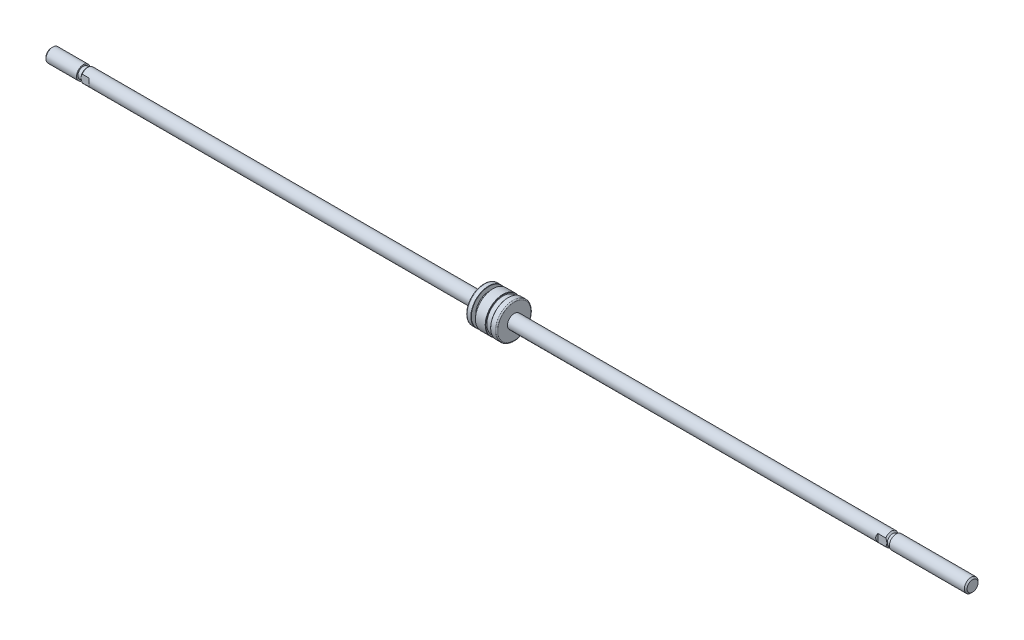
ISO-10303-21;
HEADER;
FILE_DESCRIPTION(('STEP AP214'),'2;1');
FILE_NAME('part.step','',(''),(''),'','','');
FILE_SCHEMA(('AUTOMOTIVE_DESIGN { 1 0 10303 214 1 1 1 1 }'));
ENDSEC;
DATA;
#1=APPLICATION_CONTEXT('core data for automotive mechanical design processes');
#2=APPLICATION_PROTOCOL_DEFINITION('international standard','automotive_design',2000,#1);
#3=PRODUCT_CONTEXT('',#1,'mechanical');
#4=PRODUCT('Part','Part','',(#3));
#5=PRODUCT_RELATED_PRODUCT_CATEGORY('part','',(#4));
#6=PRODUCT_DEFINITION_FORMATION('','',#4);
#7=PRODUCT_DEFINITION_CONTEXT('part definition',#1,'design');
#8=PRODUCT_DEFINITION('design','',#6,#7);
#9=PRODUCT_DEFINITION_SHAPE('','',#8);
#10=(LENGTH_UNIT() NAMED_UNIT(*) SI_UNIT(.MILLI.,.METRE.));
#11=(NAMED_UNIT(*) PLANE_ANGLE_UNIT() SI_UNIT($,.RADIAN.));
#12=(NAMED_UNIT(*) SI_UNIT($,.STERADIAN.) SOLID_ANGLE_UNIT());
#13=UNCERTAINTY_MEASURE_WITH_UNIT(LENGTH_MEASURE(1.E-05),#10,'distance_accuracy_value','');
#14=(GEOMETRIC_REPRESENTATION_CONTEXT(3) GLOBAL_UNCERTAINTY_ASSIGNED_CONTEXT((#13)) GLOBAL_UNIT_ASSIGNED_CONTEXT((#10,
#11,#12)) REPRESENTATION_CONTEXT('',''));
#15=CARTESIAN_POINT('',(0.,0.,0.));
#16=DIRECTION('',(0.,0.,1.));
#17=DIRECTION('',(1.,0.,0.));
#18=AXIS2_PLACEMENT_3D('',#15,#16,#17);
#19=CARTESIAN_POINT('',(366.,2.3865,0.));
#20=DIRECTION('',(-1.,0.,0.));
#21=DIRECTION('',(0.,0.,1.));
#22=AXIS2_PLACEMENT_3D('',#19,#20,#21);
#23=PLANE('',#22);
#24=CARTESIAN_POINT('',(366.000000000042,0.,0.));
#25=DIRECTION('',(-1.,0.,0.));
#26=DIRECTION('',(0.,0.,1.));
#27=AXIS2_PLACEMENT_3D('',#24,#25,#26);
#28=CIRCLE('',#27,2.38649999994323);
#29=CARTESIAN_POINT('',(366.000000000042,0.,2.38649999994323));
#30=VERTEX_POINT('',#29);
#31=EDGE_CURVE('E146',#30,#30,#28,.T.);
#32=ORIENTED_EDGE('',*,*,#31,.F.);
#33=EDGE_LOOP('',(#32));
#34=FACE_BOUND('',#33,.T.);
#35=ADVANCED_FACE('F17',(#34),#23,.F.);
#36=CARTESIAN_POINT('',(365.3865,0.,0.));
#37=DIRECTION('',(-1.,0.,0.));
#38=DIRECTION('',(0.,0.,1.));
#39=AXIS2_PLACEMENT_3D('',#36,#37,#38);
#40=CONICAL_SURFACE('',#39,2.9999999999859,0.785398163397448);
#41=CARTESIAN_POINT('',(365.3865,0.,0.));
#42=DIRECTION('',(-1.,0.,0.));
#43=DIRECTION('',(0.,0.,1.));
#44=AXIS2_PLACEMENT_3D('',#41,#42,#43);
#45=CIRCLE('',#44,3.);
#46=CARTESIAN_POINT('',(365.3865,0.,3.));
#47=VERTEX_POINT('',#46);
#48=EDGE_CURVE('E143',#47,#47,#45,.T.);
#49=ORIENTED_EDGE('',*,*,#48,.F.);
#50=EDGE_LOOP('',(#49));
#51=FACE_BOUND('',#50,.T.);
#52=ORIENTED_EDGE('',*,*,#31,.T.);
#53=EDGE_LOOP('',(#52));
#54=FACE_BOUND('',#53,.T.);
#55=ADVANCED_FACE('F282',(#51,#54),#40,.T.);
#56=CARTESIAN_POINT('',(366.,0.,0.));
#57=DIRECTION('',(-1.,0.,0.));
#58=DIRECTION('',(0.,0.,1.));
#59=AXIS2_PLACEMENT_3D('',#56,#57,#58);
#60=CYLINDRICAL_SURFACE('',#59,3.);
#61=CARTESIAN_POINT('',(332.5,0.,0.));
#62=DIRECTION('',(-1.,0.,0.));
#63=DIRECTION('',(0.,0.,1.));
#64=AXIS2_PLACEMENT_3D('',#61,#62,#63);
#65=CIRCLE('',#64,3.);
#66=CARTESIAN_POINT('',(332.5,0.,3.));
#67=VERTEX_POINT('',#66);
#68=EDGE_CURVE('E145',#67,#67,#65,.F.);
#69=ORIENTED_EDGE('',*,*,#68,.T.);
#70=EDGE_LOOP('',(#69));
#71=FACE_BOUND('',#70,.T.);
#72=ORIENTED_EDGE('',*,*,#48,.T.);
#73=EDGE_LOOP('',(#72));
#74=FACE_BOUND('',#73,.T.);
#75=ADVANCED_FACE('F279',(#71,#74),#60,.T.);
#76=CARTESIAN_POINT('',(332.5,2.4,0.));
#77=DIRECTION('',(1.,0.,0.));
#78=DIRECTION('',(0.,0.,-1.));
#79=AXIS2_PLACEMENT_3D('',#76,#77,#78);
#80=PLANE('',#79);
#81=ORIENTED_EDGE('',*,*,#68,.F.);
#82=EDGE_LOOP('',(#81));
#83=FACE_BOUND('',#82,.T.);
#84=CARTESIAN_POINT('',(332.5,0.,0.));
#85=DIRECTION('',(-1.,0.,0.));
#86=DIRECTION('',(0.,0.,1.));
#87=AXIS2_PLACEMENT_3D('',#84,#85,#86);
#88=CIRCLE('',#87,2.4);
#89=CARTESIAN_POINT('',(332.5,0.,2.4));
#90=VERTEX_POINT('',#89);
#91=EDGE_CURVE('E139',#90,#90,#88,.T.);
#92=ORIENTED_EDGE('',*,*,#91,.F.);
#93=EDGE_LOOP('',(#92));
#94=FACE_BOUND('',#93,.T.);
#95=ADVANCED_FACE('F275',(#83,#94),#80,.F.);
#96=CARTESIAN_POINT('',(366.,0.,0.));
#97=DIRECTION('',(-1.,0.,0.));
#98=DIRECTION('',(0.,0.,1.));
#99=AXIS2_PLACEMENT_3D('',#96,#97,#98);
#100=CYLINDRICAL_SURFACE('',#99,2.4);
#101=ORIENTED_EDGE('',*,*,#91,.T.);
#102=EDGE_LOOP('',(#101));
#103=FACE_BOUND('',#102,.T.);
#104=CARTESIAN_POINT('',(331.000000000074,0.,0.));
#105=DIRECTION('',(-1.,0.,0.));
#106=DIRECTION('',(0.,0.,1.));
#107=AXIS2_PLACEMENT_3D('',#104,#105,#106);
#108=CIRCLE('',#107,2.40000000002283);
#109=CARTESIAN_POINT('',(331.000000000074,0.,2.40000000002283));
#110=VERTEX_POINT('',#109);
#111=EDGE_CURVE('E112',#110,#110,#108,.T.);
#112=ORIENTED_EDGE('',*,*,#111,.F.);
#113=EDGE_LOOP('',(#112));
#114=FACE_BOUND('',#113,.T.);
#115=ADVANCED_FACE('F271',(#103,#114),#100,.T.);
#116=CARTESIAN_POINT('',(324.5,-6.,-5.));
#117=DIRECTION('',(-0.707106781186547,0.,0.707106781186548));
#118=DIRECTION('',(0.707106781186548,0.,0.707106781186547));
#119=AXIS2_PLACEMENT_3D('',#116,#117,#118);
#120=PLANE('',#119);
#121=CARTESIAN_POINT('',(329.5,0.,0.));
#122=DIRECTION('',(-0.707106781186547,0.,0.707106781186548));
#123=DIRECTION('',(-0.707106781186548,0.,-0.707106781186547));
#124=AXIS2_PLACEMENT_3D('',#121,#122,#123);
#125=ELLIPSE('',#124,4.24264068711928,3.);
#126=CARTESIAN_POINT('',(327.,1.65831239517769,-2.5));
#127=VERTEX_POINT('',#126);
#128=CARTESIAN_POINT('',(327.,-1.65831239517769,-2.5));
#129=VERTEX_POINT('',#128);
#130=EDGE_CURVE('E124',#127,#129,#125,.T.);
#131=ORIENTED_EDGE('',*,*,#130,.F.);
#132=DIRECTION('',(0.,1.,0.));
#133=VECTOR('',#132,1.);
#134=CARTESIAN_POINT('',(327.,-6.,-2.5));
#135=LINE('',#134,#133);
#136=EDGE_CURVE('E137',#127,#129,#135,.F.);
#137=ORIENTED_EDGE('',*,*,#136,.T.);
#138=EDGE_LOOP('',(#131,#137));
#139=FACE_BOUND('',#138,.T.);
#140=ADVANCED_FACE('F268',(#139),#120,.F.);
#141=CARTESIAN_POINT('',(327.,-6.,-2.5));
#142=DIRECTION('',(0.,0.,1.));
#143=DIRECTION('',(1.,0.,0.));
#144=AXIS2_PLACEMENT_3D('',#141,#142,#143);
#145=PLANE('',#144);
#146=DIRECTION('',(-1.,0.,0.));
#147=VECTOR('',#146,1.);
#148=CARTESIAN_POINT('',(366.,-1.65831239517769,-2.5));
#149=LINE('',#148,#147);
#150=CARTESIAN_POINT('',(330.400000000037,-1.65831239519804,-2.5));
#151=VERTEX_POINT('',#150);
#152=EDGE_CURVE('E104',#129,#151,#149,.F.);
#153=ORIENTED_EDGE('',*,*,#152,.F.);
#154=ORIENTED_EDGE('',*,*,#136,.F.);
#155=DIRECTION('',(-1.,0.,0.));
#156=VECTOR('',#155,1.);
#157=CARTESIAN_POINT('',(366.,1.6583123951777,-2.5));
#158=LINE('',#157,#156);
#159=CARTESIAN_POINT('',(330.400000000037,1.65831239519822,-2.5));
#160=VERTEX_POINT('',#159);
#161=EDGE_CURVE('E107',#160,#127,#158,.T.);
#162=ORIENTED_EDGE('',*,*,#161,.F.);
#163=CARTESIAN_POINT('',(330.400000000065,-1.65831239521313,-2.49999999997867));
#164=CARTESIAN_POINT('',(330.424586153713,-1.61382941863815,-2.49999999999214));
#165=CARTESIAN_POINT('',(330.44865019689,-1.56905834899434,-2.49999999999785));
#166=CARTESIAN_POINT('',(330.495574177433,-1.47890952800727,-2.50000000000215));
#167=CARTESIAN_POINT('',(330.518434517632,-1.43353198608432,-2.50000000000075));
#168=CARTESIAN_POINT('',(330.585193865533,-1.29598840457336,-2.49999999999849));
#169=CARTESIAN_POINT('',(330.627047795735,-1.20280974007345,-2.49999999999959));
#170=CARTESIAN_POINT('',(330.704045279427,-1.01280380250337,-2.50000000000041));
#171=CARTESIAN_POINT('',(330.739131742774,-0.91595309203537,-2.50000000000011));
#172=CARTESIAN_POINT('',(330.800211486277,-0.71943973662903,-2.49999999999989));
#173=CARTESIAN_POINT('',(330.826211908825,-0.619779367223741,-2.49999999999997));
#174=CARTESIAN_POINT('',(330.864080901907,-0.433468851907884,-2.50000000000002));
#175=CARTESIAN_POINT('',(330.87749399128,-0.347135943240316,-2.50000000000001));
#176=CARTESIAN_POINT('',(330.895435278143,-0.17386342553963,-2.49999999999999));
#177=CARTESIAN_POINT('',(330.899997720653,-0.0869274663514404,-2.5));
#178=CARTESIAN_POINT('',(330.900001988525,0.075829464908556,-2.5));
#179=CARTESIAN_POINT('',(330.896533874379,0.151652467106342,-2.5));
#180=CARTESIAN_POINT('',(330.882863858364,0.302712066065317,-2.5));
#181=CARTESIAN_POINT('',(330.872659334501,0.377948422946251,-2.5));
#182=CARTESIAN_POINT('',(330.84596560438,0.527795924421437,-2.5));
#183=CARTESIAN_POINT('',(330.82943512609,0.602399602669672,-2.5));
#184=CARTESIAN_POINT('',(330.790850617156,0.750168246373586,-2.5));
#185=CARTESIAN_POINT('',(330.768795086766,0.823332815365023,-2.5));
#186=CARTESIAN_POINT('',(330.721921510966,0.962309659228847,-2.5));
#187=CARTESIAN_POINT('',(330.697461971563,1.0282443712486,-2.5));
#188=CARTESIAN_POINT('',(330.645158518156,1.15876068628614,-2.5));
#189=CARTESIAN_POINT('',(330.617314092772,1.22334208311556,-2.5));
#190=CARTESIAN_POINT('',(330.55917440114,1.35034828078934,-2.5));
#191=CARTESIAN_POINT('',(330.528916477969,1.41279031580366,-2.5));
#192=CARTESIAN_POINT('',(330.466088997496,1.5364403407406,-2.5));
#193=CARTESIAN_POINT('',(330.433521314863,1.59764928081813,-2.5));
#194=CARTESIAN_POINT('',(330.400000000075,1.65831239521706,-2.5));
#195=B_SPLINE_CURVE_WITH_KNOTS('',3,(#163,#164,#165,#166,#167,#168,#169,#170,#171,#172,#173,
#174,#175,#176,#177,#178,#179,#180,#181,#182,#183,#184,#185,#186,#187,#188,#189,#190,#191,#192,
#193,#194),.UNSPECIFIED.,.F.,.F.,(4,2,2,2,2,2,2,2,2,2,2,2,2,2,2,4),(0.,0.152469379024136,
0.304887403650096,0.611091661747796,0.919775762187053,1.22821666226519,1.4899134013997,
1.75059554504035,1.97799648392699,2.2054859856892,2.43448570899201,2.66354766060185,
2.87441784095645,3.08531991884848,3.29342880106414,3.50137066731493),.UNSPECIFIED.);
#196=EDGE_CURVE('E99',#151,#160,#195,.T.);
#197=ORIENTED_EDGE('',*,*,#196,.F.);
#198=EDGE_LOOP('',(#153,#154,#162,#197));
#199=FACE_BOUND('',#198,.T.);
#200=ADVANCED_FACE('F101',(#199),#145,.F.);
#201=CARTESIAN_POINT('',(330.400000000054,0.,0.));
#202=DIRECTION('',(-1.,0.,0.));
#203=DIRECTION('',(0.,0.,1.));
#204=AXIS2_PLACEMENT_3D('',#201,#202,#203);
#205=CONICAL_SURFACE('',#204,3.00000000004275,0.785398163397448);
#206=ORIENTED_EDGE('',*,*,#111,.T.);
#207=EDGE_LOOP('',(#206));
#208=FACE_BOUND('',#207,.T.);
#209=CARTESIAN_POINT('',(330.4,0.,0.));
#210=DIRECTION('',(-1.,0.,0.));
#211=DIRECTION('',(0.,0.,1.));
#212=AXIS2_PLACEMENT_3D('',#209,#210,#211);
#213=CIRCLE('',#212,3.);
#214=CARTESIAN_POINT('',(330.400000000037,-1.65831239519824,2.5));
#215=VERTEX_POINT('',#214);
#216=EDGE_CURVE('E115',#151,#215,#213,.T.);
#217=ORIENTED_EDGE('',*,*,#216,.F.);
#218=ORIENTED_EDGE('',*,*,#196,.T.);
#219=CARTESIAN_POINT('',(330.4,0.,0.));
#220=DIRECTION('',(-1.,0.,0.));
#221=DIRECTION('',(0.,0.,1.));
#222=AXIS2_PLACEMENT_3D('',#219,#220,#221);
#223=CIRCLE('',#222,3.);
#224=CARTESIAN_POINT('',(330.400000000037,1.65831239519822,2.5));
#225=VERTEX_POINT('',#224);
#226=EDGE_CURVE('E131',#225,#160,#223,.T.);
#227=ORIENTED_EDGE('',*,*,#226,.F.);
#228=CARTESIAN_POINT('',(330.400000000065,1.65831239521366,2.49999999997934));
#229=CARTESIAN_POINT('',(330.424586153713,1.61382941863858,2.49999999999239));
#230=CARTESIAN_POINT('',(330.44865019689,1.56905834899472,2.49999999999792));
#231=CARTESIAN_POINT('',(330.495574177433,1.47890952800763,2.50000000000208));
#232=CARTESIAN_POINT('',(330.518434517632,1.4335319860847,2.50000000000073));
#233=CARTESIAN_POINT('',(330.585193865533,1.29598840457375,2.49999999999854));
#234=CARTESIAN_POINT('',(330.627047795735,1.20280974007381,2.49999999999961));
#235=CARTESIAN_POINT('',(330.704045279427,1.0128038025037,2.5000000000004));
#236=CARTESIAN_POINT('',(330.739131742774,0.915953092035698,2.50000000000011));
#237=CARTESIAN_POINT('',(330.800211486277,0.719439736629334,2.4999999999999));
#238=CARTESIAN_POINT('',(330.826211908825,0.619779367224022,2.49999999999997));
#239=CARTESIAN_POINT('',(330.864080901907,0.43346885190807,2.50000000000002));
#240=CARTESIAN_POINT('',(330.87749399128,0.347135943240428,2.50000000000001));
#241=CARTESIAN_POINT('',(330.895435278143,0.173863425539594,2.49999999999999));
#242=CARTESIAN_POINT('',(330.899997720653,0.0869274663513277,2.5));
#243=CARTESIAN_POINT('',(330.900001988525,-0.0758294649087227,2.5));
#244=CARTESIAN_POINT('',(330.896533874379,-0.151652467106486,2.5));
#245=CARTESIAN_POINT('',(330.882863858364,-0.302712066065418,2.5));
#246=CARTESIAN_POINT('',(330.872659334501,-0.377948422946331,2.5));
#247=CARTESIAN_POINT('',(330.84596560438,-0.527795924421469,2.5));
#248=CARTESIAN_POINT('',(330.82943512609,-0.602399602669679,2.5));
#249=CARTESIAN_POINT('',(330.790850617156,-0.750168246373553,2.5));
#250=CARTESIAN_POINT('',(330.768795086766,-0.823332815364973,2.5));
#251=CARTESIAN_POINT('',(330.721921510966,-0.9623096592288,2.5));
#252=CARTESIAN_POINT('',(330.697461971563,-1.02824437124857,2.5));
#253=CARTESIAN_POINT('',(330.645158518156,-1.15876068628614,2.5));
#254=CARTESIAN_POINT('',(330.617314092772,-1.22334208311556,2.5));
#255=CARTESIAN_POINT('',(330.55917440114,-1.35034828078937,2.5));
#256=CARTESIAN_POINT('',(330.528916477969,-1.41279031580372,2.5));
#257=CARTESIAN_POINT('',(330.466088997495,-1.53644034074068,2.5));
#258=CARTESIAN_POINT('',(330.433521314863,-1.59764928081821,2.5));
#259=CARTESIAN_POINT('',(330.400000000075,-1.65831239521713,2.5));
#260=B_SPLINE_CURVE_WITH_KNOTS('',3,(#228,#229,#230,#231,#232,#233,#234,#235,#236,#237,#238,
#239,#240,#241,#242,#243,#244,#245,#246,#247,#248,#249,#250,#251,#252,#253,#254,#255,#256,#257,
#258,#259),.UNSPECIFIED.,.F.,.F.,(4,2,2,2,2,2,2,2,2,2,2,2,2,2,2,4),(0.,0.152469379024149,
0.304887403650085,0.611091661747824,0.919775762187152,1.22821666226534,1.48991340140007,
1.75059554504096,1.97799648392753,2.20548598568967,2.43448570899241,2.6635476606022,
2.87441784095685,3.08531991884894,3.29342880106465,3.50137066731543),.UNSPECIFIED.);
#261=EDGE_CURVE('E111',#225,#215,#260,.T.);
#262=ORIENTED_EDGE('',*,*,#261,.T.);
#263=EDGE_LOOP('',(#217,#218,#227,#262));
#264=FACE_BOUND('',#263,.T.);
#265=ADVANCED_FACE('F116',(#208,#264),#205,.T.);
#266=CARTESIAN_POINT('',(331.,-6.,2.5));
#267=DIRECTION('',(0.,0.,-1.));
#268=DIRECTION('',(-1.,0.,0.));
#269=AXIS2_PLACEMENT_3D('',#266,#267,#268);
#270=PLANE('',#269);
#271=DIRECTION('',(-1.,0.,0.));
#272=VECTOR('',#271,1.);
#273=CARTESIAN_POINT('',(366.,1.65831239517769,2.5));
#274=LINE('',#273,#272);
#275=CARTESIAN_POINT('',(327.,1.65831239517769,2.5));
#276=VERTEX_POINT('',#275);
#277=EDGE_CURVE('E132',#276,#225,#274,.F.);
#278=ORIENTED_EDGE('',*,*,#277,.F.);
#279=DIRECTION('',(0.,1.,0.));
#280=VECTOR('',#279,1.);
#281=CARTESIAN_POINT('',(327.,-6.,2.5));
#282=LINE('',#281,#280);
#283=CARTESIAN_POINT('',(327.,-1.6583123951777,2.5));
#284=VERTEX_POINT('',#283);
#285=EDGE_CURVE('E135',#276,#284,#282,.F.);
#286=ORIENTED_EDGE('',*,*,#285,.T.);
#287=DIRECTION('',(-1.,0.,0.));
#288=VECTOR('',#287,1.);
#289=CARTESIAN_POINT('',(366.,-1.6583123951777,2.5));
#290=LINE('',#289,#288);
#291=EDGE_CURVE('E120',#215,#284,#290,.T.);
#292=ORIENTED_EDGE('',*,*,#291,.F.);
#293=ORIENTED_EDGE('',*,*,#261,.F.);
#294=EDGE_LOOP('',(#278,#286,#292,#293));
#295=FACE_BOUND('',#294,.T.);
#296=ADVANCED_FACE('F258',(#295),#270,.F.);
#297=CARTESIAN_POINT('',(327.,-6.,2.5));
#298=DIRECTION('',(-0.707106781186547,0.,-0.707106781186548));
#299=DIRECTION('',(-0.707106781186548,0.,0.707106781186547));
#300=AXIS2_PLACEMENT_3D('',#297,#298,#299);
#301=PLANE('',#300);
#302=ORIENTED_EDGE('',*,*,#285,.F.);
#303=CARTESIAN_POINT('',(329.5,0.,0.));
#304=DIRECTION('',(-0.707106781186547,0.,-0.707106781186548));
#305=DIRECTION('',(-0.707106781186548,0.,0.707106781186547));
#306=AXIS2_PLACEMENT_3D('',#303,#304,#305);
#307=ELLIPSE('',#306,4.24264068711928,3.);
#308=EDGE_CURVE('E246',#284,#276,#307,.T.);
#309=ORIENTED_EDGE('',*,*,#308,.F.);
#310=EDGE_LOOP('',(#302,#309));
#311=FACE_BOUND('',#310,.T.);
#312=ADVANCED_FACE('F475',(#311),#301,.F.);
#313=CARTESIAN_POINT('',(366.,0.,0.));
#314=DIRECTION('',(-1.,0.,0.));
#315=DIRECTION('',(0.,0.,1.));
#316=AXIS2_PLACEMENT_3D('',#313,#314,#315);
#317=CYLINDRICAL_SURFACE('',#316,3.);
#318=ORIENTED_EDGE('',*,*,#161,.T.);
#319=ORIENTED_EDGE('',*,*,#130,.T.);
#320=ORIENTED_EDGE('',*,*,#152,.T.);
#321=ORIENTED_EDGE('',*,*,#216,.T.);
#322=ORIENTED_EDGE('',*,*,#291,.T.);
#323=ORIENTED_EDGE('',*,*,#308,.T.);
#324=ORIENTED_EDGE('',*,*,#277,.T.);
#325=ORIENTED_EDGE('',*,*,#226,.T.);
#326=EDGE_LOOP('',(#318,#319,#320,#321,#322,#323,#324,#325));
#327=FACE_BOUND('',#326,.T.);
#328=CARTESIAN_POINT('',(165.,0.,0.));
#329=DIRECTION('',(-1.,0.,0.));
#330=DIRECTION('',(0.,0.,1.));
#331=AXIS2_PLACEMENT_3D('',#328,#329,#330);
#332=CIRCLE('',#331,3.);
#333=CARTESIAN_POINT('',(165.,0.,3.));
#334=VERTEX_POINT('',#333);
#335=EDGE_CURVE('E242',#334,#334,#332,.F.);
#336=ORIENTED_EDGE('',*,*,#335,.T.);
#337=EDGE_LOOP('',(#336));
#338=FACE_BOUND('',#337,.T.);
#339=ADVANCED_FACE('F122',(#327,#338),#317,.T.);
#340=CARTESIAN_POINT('',(165.,7.25,0.));
#341=DIRECTION('',(-1.,0.,0.));
#342=DIRECTION('',(0.,0.,1.));
#343=AXIS2_PLACEMENT_3D('',#340,#341,#342);
#344=PLANE('',#343);
#345=ORIENTED_EDGE('',*,*,#335,.F.);
#346=EDGE_LOOP('',(#345));
#347=FACE_BOUND('',#346,.T.);
#348=CARTESIAN_POINT('',(165.,0.,0.));
#349=DIRECTION('',(-1.,0.,0.));
#350=DIRECTION('',(0.,0.,-1.));
#351=AXIS2_PLACEMENT_3D('',#348,#349,#350);
#352=CIRCLE('',#351,7.25);
#353=CARTESIAN_POINT('',(165.,0.,-7.25));
#354=VERTEX_POINT('',#353);
#355=CARTESIAN_POINT('',(165.,0.,7.25));
#356=VERTEX_POINT('',#355);
#357=EDGE_CURVE('E433',#354,#356,#352,.T.);
#358=ORIENTED_EDGE('',*,*,#357,.F.);
#359=CARTESIAN_POINT('',(165.,0.,0.));
#360=DIRECTION('',(-1.,0.,0.));
#361=DIRECTION('',(0.,0.,1.));
#362=AXIS2_PLACEMENT_3D('',#359,#360,#361);
#363=CIRCLE('',#362,7.25);
#364=EDGE_CURVE('E245',#356,#354,#363,.T.);
#365=ORIENTED_EDGE('',*,*,#364,.F.);
#366=EDGE_LOOP('',(#358,#365));
#367=FACE_BOUND('',#366,.T.);
#368=ADVANCED_FACE('F438',(#347,#367),#344,.F.);
#369=CARTESIAN_POINT('',(164.5,0.,0.));
#370=DIRECTION('',(-1.,0.,0.));
#371=DIRECTION('',(0.,0.,1.));
#372=AXIS2_PLACEMENT_3D('',#369,#370,#371);
#373=TOROIDAL_SURFACE('',#372,7.25000000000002,0.499999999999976);
#374=ORIENTED_EDGE('',*,*,#364,.T.);
#375=ORIENTED_EDGE('',*,*,#357,.T.);
#376=EDGE_LOOP('',(#374,#375));
#377=FACE_BOUND('',#376,.T.);
#378=CARTESIAN_POINT('',(164.5,0.,0.));
#379=DIRECTION('',(-1.,0.,0.));
#380=DIRECTION('',(0.,0.,1.));
#381=AXIS2_PLACEMENT_3D('',#378,#379,#380);
#382=CIRCLE('',#381,7.75);
#383=CARTESIAN_POINT('',(164.5,0.,7.75));
#384=VERTEX_POINT('',#383);
#385=EDGE_CURVE('E439',#384,#384,#382,.T.);
#386=ORIENTED_EDGE('',*,*,#385,.F.);
#387=EDGE_LOOP('',(#386));
#388=FACE_BOUND('',#387,.T.);
#389=ADVANCED_FACE('F431',(#377,#388),#373,.T.);
#390=CARTESIAN_POINT('',(165.,0.,0.));
#391=DIRECTION('',(-1.,0.,0.));
#392=DIRECTION('',(0.,0.,1.));
#393=AXIS2_PLACEMENT_3D('',#390,#391,#392);
#394=CYLINDRICAL_SURFACE('',#393,7.75);
#395=ORIENTED_EDGE('',*,*,#385,.T.);
#396=EDGE_LOOP('',(#395));
#397=FACE_BOUND('',#396,.T.);
#398=CARTESIAN_POINT('',(162.4,0.,0.));
#399=DIRECTION('',(1.,0.,0.));
#400=DIRECTION('',(0.,0.,-1.));
#401=AXIS2_PLACEMENT_3D('',#398,#399,#400);
#402=CIRCLE('',#401,7.75);
#403=CARTESIAN_POINT('',(162.4,0.,-7.75));
#404=VERTEX_POINT('',#403);
#405=EDGE_CURVE('E241',#404,#404,#402,.F.);
#406=ORIENTED_EDGE('',*,*,#405,.F.);
#407=EDGE_LOOP('',(#406));
#408=FACE_BOUND('',#407,.T.);
#409=ADVANCED_FACE('F569',(#397,#408),#394,.T.);
#410=CARTESIAN_POINT('',(162.4,0.,0.));
#411=DIRECTION('',(1.,0.,0.));
#412=DIRECTION('',(0.,0.,-1.));
#413=AXIS2_PLACEMENT_3D('',#410,#411,#412);
#414=CONICAL_SURFACE('',#413,7.75,0.785398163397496);
#415=CARTESIAN_POINT('',(162.3,0.,0.));
#416=DIRECTION('',(1.,0.,0.));
#417=DIRECTION('',(0.,0.,-1.));
#418=AXIS2_PLACEMENT_3D('',#415,#416,#417);
#419=CIRCLE('',#418,7.65000000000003);
#420=CARTESIAN_POINT('',(162.3,0.,-7.65000000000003));
#421=VERTEX_POINT('',#420);
#422=EDGE_CURVE('E237',#421,#421,#419,.T.);
#423=ORIENTED_EDGE('',*,*,#422,.T.);
#424=EDGE_LOOP('',(#423));
#425=FACE_BOUND('',#424,.T.);
#426=ORIENTED_EDGE('',*,*,#405,.T.);
#427=EDGE_LOOP('',(#426));
#428=FACE_BOUND('',#427,.T.);
#429=ADVANCED_FACE('F576',(#425,#428),#414,.T.);
#430=CARTESIAN_POINT('',(162.3,7.27,0.));
#431=DIRECTION('',(1.,0.,0.));
#432=DIRECTION('',(0.,0.,-1.));
#433=AXIS2_PLACEMENT_3D('',#430,#431,#432);
#434=PLANE('',#433);
#435=ORIENTED_EDGE('',*,*,#422,.F.);
#436=EDGE_LOOP('',(#435));
#437=FACE_BOUND('',#436,.T.);
#438=CARTESIAN_POINT('',(162.3,0.,0.));
#439=DIRECTION('',(-1.,0.,0.));
#440=DIRECTION('',(0.,0.,-1.));
#441=AXIS2_PLACEMENT_3D('',#438,#439,#440);
#442=CIRCLE('',#441,7.27000000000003);
#443=CARTESIAN_POINT('',(162.3,0.,7.27000000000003));
#444=VERTEX_POINT('',#443);
#445=CARTESIAN_POINT('',(162.3,0.,-7.27000000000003));
#446=VERTEX_POINT('',#445);
#447=EDGE_CURVE('E240',#444,#446,#442,.F.);
#448=ORIENTED_EDGE('',*,*,#447,.T.);
#449=CARTESIAN_POINT('',(162.3,0.,0.));
#450=DIRECTION('',(-1.,0.,0.));
#451=DIRECTION('',(0.,0.,1.));
#452=AXIS2_PLACEMENT_3D('',#449,#450,#451);
#453=CIRCLE('',#452,7.27000000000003);
#454=EDGE_CURVE('E392',#446,#444,#453,.F.);
#455=ORIENTED_EDGE('',*,*,#454,.T.);
#456=EDGE_LOOP('',(#448,#455));
#457=FACE_BOUND('',#456,.T.);
#458=ADVANCED_FACE('F404',(#437,#457),#434,.F.);
#459=CARTESIAN_POINT('',(162.2,0.,0.));
#460=DIRECTION('',(-1.,0.,0.));
#461=DIRECTION('',(0.,0.,1.));
#462=AXIS2_PLACEMENT_3D('',#459,#460,#461);
#463=TOROIDAL_SURFACE('',#462,7.27000000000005,0.100000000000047);
#464=CARTESIAN_POINT('',(162.2,0.,0.));
#465=DIRECTION('',(-1.,0.,0.));
#466=DIRECTION('',(0.,0.,1.));
#467=AXIS2_PLACEMENT_3D('',#464,#465,#466);
#468=CIRCLE('',#467,7.17);
#469=CARTESIAN_POINT('',(162.2,0.,7.17));
#470=VERTEX_POINT('',#469);
#471=EDGE_CURVE('E236',#470,#470,#468,.T.);
#472=ORIENTED_EDGE('',*,*,#471,.F.);
#473=EDGE_LOOP('',(#472));
#474=FACE_BOUND('',#473,.T.);
#475=ORIENTED_EDGE('',*,*,#447,.F.);
#476=ORIENTED_EDGE('',*,*,#454,.F.);
#477=EDGE_LOOP('',(#475,#476));
#478=FACE_BOUND('',#477,.T.);
#479=ADVANCED_FACE('F398',(#474,#478),#463,.F.);
#480=CARTESIAN_POINT('',(165.,0.,0.));
#481=DIRECTION('',(-1.,0.,0.));
#482=DIRECTION('',(0.,0.,1.));
#483=AXIS2_PLACEMENT_3D('',#480,#481,#482);
#484=CYLINDRICAL_SURFACE('',#483,7.17);
#485=CARTESIAN_POINT('',(160.1,0.,0.));
#486=DIRECTION('',(-1.,0.,0.));
#487=DIRECTION('',(0.,0.,1.));
#488=AXIS2_PLACEMENT_3D('',#485,#486,#487);
#489=CIRCLE('',#488,7.17);
#490=CARTESIAN_POINT('',(160.1,0.,7.17));
#491=VERTEX_POINT('',#490);
#492=EDGE_CURVE('E233',#491,#491,#489,.F.);
#493=ORIENTED_EDGE('',*,*,#492,.T.);
#494=EDGE_LOOP('',(#493));
#495=FACE_BOUND('',#494,.T.);
#496=ORIENTED_EDGE('',*,*,#471,.T.);
#497=EDGE_LOOP('',(#496));
#498=FACE_BOUND('',#497,.T.);
#499=ADVANCED_FACE('F403',(#495,#498),#484,.T.);
#500=CARTESIAN_POINT('',(160.1,7.65,0.));
#501=DIRECTION('',(-1.,0.,0.));
#502=DIRECTION('',(0.,0.,1.));
#503=AXIS2_PLACEMENT_3D('',#500,#501,#502);
#504=PLANE('',#503);
#505=ORIENTED_EDGE('',*,*,#492,.F.);
#506=EDGE_LOOP('',(#505));
#507=FACE_BOUND('',#506,.T.);
#508=CARTESIAN_POINT('',(160.1,0.,0.));
#509=DIRECTION('',(-1.,0.,0.));
#510=DIRECTION('',(0.,0.,1.));
#511=AXIS2_PLACEMENT_3D('',#508,#509,#510);
#512=CIRCLE('',#511,7.65);
#513=CARTESIAN_POINT('',(160.1,0.,7.65));
#514=VERTEX_POINT('',#513);
#515=EDGE_CURVE('E229',#514,#514,#512,.T.);
#516=ORIENTED_EDGE('',*,*,#515,.F.);
#517=EDGE_LOOP('',(#516));
#518=FACE_BOUND('',#517,.T.);
#519=ADVANCED_FACE('F603',(#507,#518),#504,.F.);
#520=CARTESIAN_POINT('',(160.,0.,0.));
#521=DIRECTION('',(-1.,0.,0.));
#522=DIRECTION('',(0.,0.,1.));
#523=AXIS2_PLACEMENT_3D('',#520,#521,#522);
#524=CONICAL_SURFACE('',#523,7.75,0.7853981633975);
#525=ORIENTED_EDGE('',*,*,#515,.T.);
#526=EDGE_LOOP('',(#525));
#527=FACE_BOUND('',#526,.T.);
#528=CARTESIAN_POINT('',(160.,0.,0.));
#529=DIRECTION('',(-1.,0.,0.));
#530=DIRECTION('',(0.,0.,1.));
#531=AXIS2_PLACEMENT_3D('',#528,#529,#530);
#532=CIRCLE('',#531,7.75);
#533=CARTESIAN_POINT('',(160.,0.,7.75));
#534=VERTEX_POINT('',#533);
#535=EDGE_CURVE('E232',#534,#534,#532,.T.);
#536=ORIENTED_EDGE('',*,*,#535,.F.);
#537=EDGE_LOOP('',(#536));
#538=FACE_BOUND('',#537,.T.);
#539=ADVANCED_FACE('F611',(#527,#538),#524,.T.);
#540=CARTESIAN_POINT('',(165.,0.,0.));
#541=DIRECTION('',(-1.,0.,0.));
#542=DIRECTION('',(0.,0.,1.));
#543=AXIS2_PLACEMENT_3D('',#540,#541,#542);
#544=CYLINDRICAL_SURFACE('',#543,7.75);
#545=ORIENTED_EDGE('',*,*,#535,.T.);
#546=EDGE_LOOP('',(#545));
#547=FACE_BOUND('',#546,.T.);
#548=CARTESIAN_POINT('',(155.7,0.,0.));
#549=DIRECTION('',(1.,0.,0.));
#550=DIRECTION('',(0.,0.,-1.));
#551=AXIS2_PLACEMENT_3D('',#548,#549,#550);
#552=CIRCLE('',#551,7.75);
#553=CARTESIAN_POINT('',(155.7,0.,-7.75));
#554=VERTEX_POINT('',#553);
#555=EDGE_CURVE('E228',#554,#554,#552,.F.);
#556=ORIENTED_EDGE('',*,*,#555,.F.);
#557=EDGE_LOOP('',(#556));
#558=FACE_BOUND('',#557,.T.);
#559=ADVANCED_FACE('F619',(#547,#558),#544,.T.);
#560=CARTESIAN_POINT('',(155.7,0.,0.));
#561=DIRECTION('',(1.,0.,0.));
#562=DIRECTION('',(0.,0.,-1.));
#563=AXIS2_PLACEMENT_3D('',#560,#561,#562);
#564=CONICAL_SURFACE('',#563,7.75,0.785398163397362);
#565=CARTESIAN_POINT('',(155.6,0.,0.));
#566=DIRECTION('',(1.,0.,0.));
#567=DIRECTION('',(0.,0.,-1.));
#568=AXIS2_PLACEMENT_3D('',#565,#566,#567);
#569=CIRCLE('',#568,7.65);
#570=CARTESIAN_POINT('',(155.6,0.,-7.65));
#571=VERTEX_POINT('',#570);
#572=EDGE_CURVE('E225',#571,#571,#569,.T.);
#573=ORIENTED_EDGE('',*,*,#572,.T.);
#574=EDGE_LOOP('',(#573));
#575=FACE_BOUND('',#574,.T.);
#576=ORIENTED_EDGE('',*,*,#555,.T.);
#577=EDGE_LOOP('',(#576));
#578=FACE_BOUND('',#577,.T.);
#579=ADVANCED_FACE('F628',(#575,#578),#564,.T.);
#580=CARTESIAN_POINT('',(155.6,5.7,0.));
#581=DIRECTION('',(1.,0.,0.));
#582=DIRECTION('',(0.,0.,-1.));
#583=AXIS2_PLACEMENT_3D('',#580,#581,#582);
#584=PLANE('',#583);
#585=ORIENTED_EDGE('',*,*,#572,.F.);
#586=EDGE_LOOP('',(#585));
#587=FACE_BOUND('',#586,.T.);
#588=CARTESIAN_POINT('',(155.6,0.,0.));
#589=DIRECTION('',(-1.,0.,0.));
#590=DIRECTION('',(0.,0.,1.));
#591=AXIS2_PLACEMENT_3D('',#588,#589,#590);
#592=CIRCLE('',#591,5.7);
#593=CARTESIAN_POINT('',(155.6,0.,5.7));
#594=VERTEX_POINT('',#593);
#595=EDGE_CURVE('E222',#594,#594,#592,.T.);
#596=ORIENTED_EDGE('',*,*,#595,.F.);
#597=EDGE_LOOP('',(#596));
#598=FACE_BOUND('',#597,.T.);
#599=ADVANCED_FACE('F637',(#587,#598),#584,.F.);
#600=CARTESIAN_POINT('',(165.,0.,0.));
#601=DIRECTION('',(-1.,0.,0.));
#602=DIRECTION('',(0.,0.,1.));
#603=AXIS2_PLACEMENT_3D('',#600,#601,#602);
#604=CYLINDRICAL_SURFACE('',#603,5.7);
#605=CARTESIAN_POINT('',(153.8,0.,0.));
#606=DIRECTION('',(-1.,0.,0.));
#607=DIRECTION('',(0.,0.,1.));
#608=AXIS2_PLACEMENT_3D('',#605,#606,#607);
#609=CIRCLE('',#608,5.7);
#610=CARTESIAN_POINT('',(153.8,0.,5.7));
#611=VERTEX_POINT('',#610);
#612=EDGE_CURVE('E219',#611,#611,#609,.F.);
#613=ORIENTED_EDGE('',*,*,#612,.T.);
#614=EDGE_LOOP('',(#613));
#615=FACE_BOUND('',#614,.T.);
#616=ORIENTED_EDGE('',*,*,#595,.T.);
#617=EDGE_LOOP('',(#616));
#618=FACE_BOUND('',#617,.T.);
#619=ADVANCED_FACE('F646',(#615,#618),#604,.T.);
#620=CARTESIAN_POINT('',(153.8,7.65,0.));
#621=DIRECTION('',(-1.,0.,0.));
#622=DIRECTION('',(0.,0.,1.));
#623=AXIS2_PLACEMENT_3D('',#620,#621,#622);
#624=PLANE('',#623);
#625=ORIENTED_EDGE('',*,*,#612,.F.);
#626=EDGE_LOOP('',(#625));
#627=FACE_BOUND('',#626,.T.);
#628=CARTESIAN_POINT('',(153.8,0.,0.));
#629=DIRECTION('',(-1.,0.,0.));
#630=DIRECTION('',(0.,-1.,0.));
#631=AXIS2_PLACEMENT_3D('',#628,#629,#630);
#632=CIRCLE('',#631,7.65);
#633=CARTESIAN_POINT('',(153.8,-7.65,0.));
#634=VERTEX_POINT('',#633);
#635=EDGE_CURVE('E216',#634,#634,#632,.T.);
#636=ORIENTED_EDGE('',*,*,#635,.F.);
#637=EDGE_LOOP('',(#636));
#638=FACE_BOUND('',#637,.T.);
#639=ADVANCED_FACE('F655',(#627,#638),#624,.F.);
#640=CARTESIAN_POINT('',(153.7,0.,0.));
#641=DIRECTION('',(-1.,0.,0.));
#642=DIRECTION('',(0.,-1.,0.));
#643=AXIS2_PLACEMENT_3D('',#640,#641,#642);
#644=CONICAL_SURFACE('',#643,7.75,0.7853981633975);
#645=CARTESIAN_POINT('',(153.7,0.,0.));
#646=DIRECTION('',(-1.,0.,0.));
#647=DIRECTION('',(0.,0.,1.));
#648=AXIS2_PLACEMENT_3D('',#645,#646,#647);
#649=CIRCLE('',#648,7.75);
#650=CARTESIAN_POINT('',(153.7,0.,7.75));
#651=VERTEX_POINT('',#650);
#652=EDGE_CURVE('E215',#651,#651,#649,.T.);
#653=ORIENTED_EDGE('',*,*,#652,.F.);
#654=EDGE_LOOP('',(#653));
#655=FACE_BOUND('',#654,.T.);
#656=ORIENTED_EDGE('',*,*,#635,.T.);
#657=EDGE_LOOP('',(#656));
#658=FACE_BOUND('',#657,.T.);
#659=ADVANCED_FACE('F664',(#655,#658),#644,.T.);
#660=CARTESIAN_POINT('',(-38.,0.,0.));
#661=DIRECTION('',(1.,0.,0.));
#662=DIRECTION('',(0.,0.,-1.));
#663=AXIS2_PLACEMENT_3D('',#660,#661,#662);
#664=PLANE('',#663);
#665=CARTESIAN_POINT('',(-38.0000000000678,0.,0.));
#666=DIRECTION('',(1.,0.,0.));
#667=DIRECTION('',(0.,0.,-1.));
#668=AXIS2_PLACEMENT_3D('',#665,#666,#667);
#669=CIRCLE('',#668,2.38650000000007);
#670=CARTESIAN_POINT('',(-38.0000000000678,0.,-2.38650000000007));
#671=VERTEX_POINT('',#670);
#672=EDGE_CURVE('E211',#671,#671,#669,.T.);
#673=ORIENTED_EDGE('',*,*,#672,.F.);
#674=EDGE_LOOP('',(#673));
#675=FACE_BOUND('',#674,.T.);
#676=ADVANCED_FACE('F673',(#675),#664,.F.);
#677=CARTESIAN_POINT('',(165.,0.,0.));
#678=DIRECTION('',(-1.,0.,0.));
#679=DIRECTION('',(0.,0.,1.));
#680=AXIS2_PLACEMENT_3D('',#677,#678,#679);
#681=CYLINDRICAL_SURFACE('',#680,7.75);
#682=CARTESIAN_POINT('',(152.1,0.,0.));
#683=DIRECTION('',(-1.,0.,0.));
#684=DIRECTION('',(0.,0.,1.));
#685=AXIS2_PLACEMENT_3D('',#682,#683,#684);
#686=CIRCLE('',#685,7.75000000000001);
#687=CARTESIAN_POINT('',(152.1,0.,7.75000000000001));
#688=VERTEX_POINT('',#687);
#689=EDGE_CURVE('E214',#688,#688,#686,.T.);
#690=ORIENTED_EDGE('',*,*,#689,.F.);
#691=EDGE_LOOP('',(#690));
#692=FACE_BOUND('',#691,.T.);
#693=ORIENTED_EDGE('',*,*,#652,.T.);
#694=EDGE_LOOP('',(#693));
#695=FACE_BOUND('',#694,.T.);
#696=ADVANCED_FACE('F682',(#692,#695),#681,.T.);
#697=CARTESIAN_POINT('',(-37.3865000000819,0.,0.));
#698=DIRECTION('',(1.,0.,0.));
#699=DIRECTION('',(0.,0.,-1.));
#700=AXIS2_PLACEMENT_3D('',#697,#698,#699);
#701=CONICAL_SURFACE('',#700,2.9999999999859,0.785398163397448);
#702=CARTESIAN_POINT('',(-37.3865,0.,0.));
#703=DIRECTION('',(-1.,0.,0.));
#704=DIRECTION('',(0.,0.,1.));
#705=AXIS2_PLACEMENT_3D('',#702,#703,#704);
#706=CIRCLE('',#705,3.);
#707=CARTESIAN_POINT('',(-37.3865,0.,3.));
#708=VERTEX_POINT('',#707);
#709=EDGE_CURVE('E372',#708,#708,#706,.F.);
#710=ORIENTED_EDGE('',*,*,#709,.F.);
#711=EDGE_LOOP('',(#710));
#712=FACE_BOUND('',#711,.T.);
#713=ORIENTED_EDGE('',*,*,#672,.T.);
#714=EDGE_LOOP('',(#713));
#715=FACE_BOUND('',#714,.T.);
#716=ADVANCED_FACE('F691',(#712,#715),#701,.T.);
#717=CARTESIAN_POINT('',(152.1,0.,0.));
#718=DIRECTION('',(-1.,0.,0.));
#719=DIRECTION('',(0.,0.,1.));
#720=AXIS2_PLACEMENT_3D('',#717,#718,#719);
#721=TOROIDAL_SURFACE('',#720,7.24999999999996,0.500000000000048);
#722=CARTESIAN_POINT('',(151.6,0.,0.));
#723=DIRECTION('',(1.,0.,0.));
#724=DIRECTION('',(0.,0.,1.));
#725=AXIS2_PLACEMENT_3D('',#722,#723,#724);
#726=CIRCLE('',#725,7.24999999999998);
#727=CARTESIAN_POINT('',(151.6,0.,7.24999999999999));
#728=VERTEX_POINT('',#727);
#729=CARTESIAN_POINT('',(151.6,0.,-7.24999999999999));
#730=VERTEX_POINT('',#729);
#731=EDGE_CURVE('E368',#728,#730,#726,.T.);
#732=ORIENTED_EDGE('',*,*,#731,.T.);
#733=CARTESIAN_POINT('',(151.6,0.,0.));
#734=DIRECTION('',(1.,0.,0.));
#735=DIRECTION('',(0.,0.,-1.));
#736=AXIS2_PLACEMENT_3D('',#733,#734,#735);
#737=CIRCLE('',#736,7.24999999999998);
#738=EDGE_CURVE('E210',#730,#728,#737,.T.);
#739=ORIENTED_EDGE('',*,*,#738,.T.);
#740=EDGE_LOOP('',(#732,#739));
#741=FACE_BOUND('',#740,.T.);
#742=ORIENTED_EDGE('',*,*,#689,.T.);
#743=EDGE_LOOP('',(#742));
#744=FACE_BOUND('',#743,.T.);
#745=ADVANCED_FACE('F700',(#741,#744),#721,.T.);
#746=CARTESIAN_POINT('',(165.,0.,0.));
#747=DIRECTION('',(-1.,0.,0.));
#748=DIRECTION('',(0.,0.,1.));
#749=AXIS2_PLACEMENT_3D('',#746,#747,#748);
#750=CYLINDRICAL_SURFACE('',#749,3.);
#751=ORIENTED_EDGE('',*,*,#709,.T.);
#752=EDGE_LOOP('',(#751));
#753=FACE_BOUND('',#752,.T.);
#754=CARTESIAN_POINT('',(-24.,0.,0.));
#755=DIRECTION('',(-1.,0.,0.));
#756=DIRECTION('',(0.,0.,1.));
#757=AXIS2_PLACEMENT_3D('',#754,#755,#756);
#758=CIRCLE('',#757,3.);
#759=CARTESIAN_POINT('',(-24.,0.,3.));
#760=VERTEX_POINT('',#759);
#761=EDGE_CURVE('E207',#760,#760,#758,.T.);
#762=ORIENTED_EDGE('',*,*,#761,.T.);
#763=EDGE_LOOP('',(#762));
#764=FACE_BOUND('',#763,.T.);
#765=ADVANCED_FACE('F343',(#753,#764),#750,.T.);
#766=CARTESIAN_POINT('',(151.6,2.9,0.));
#767=DIRECTION('',(1.,0.,0.));
#768=DIRECTION('',(0.,0.,-1.));
#769=AXIS2_PLACEMENT_3D('',#766,#767,#768);
#770=PLANE('',#769);
#771=ORIENTED_EDGE('',*,*,#731,.F.);
#772=ORIENTED_EDGE('',*,*,#738,.F.);
#773=EDGE_LOOP('',(#771,#772));
#774=FACE_BOUND('',#773,.T.);
#775=CARTESIAN_POINT('',(151.6,0.,0.));
#776=DIRECTION('',(-1.,0.,0.));
#777=DIRECTION('',(0.,0.,1.));
#778=AXIS2_PLACEMENT_3D('',#775,#776,#777);
#779=CIRCLE('',#778,2.9);
#780=CARTESIAN_POINT('',(151.6,0.,2.9));
#781=VERTEX_POINT('',#780);
#782=EDGE_CURVE('E204',#781,#781,#779,.T.);
#783=ORIENTED_EDGE('',*,*,#782,.F.);
#784=EDGE_LOOP('',(#783));
#785=FACE_BOUND('',#784,.T.);
#786=ADVANCED_FACE('F338',(#774,#785),#770,.F.);
#787=CARTESIAN_POINT('',(-24.,3.,0.));
#788=DIRECTION('',(-1.,0.,0.));
#789=DIRECTION('',(0.,0.,1.));
#790=AXIS2_PLACEMENT_3D('',#787,#788,#789);
#791=PLANE('',#790);
#792=CARTESIAN_POINT('',(-24.,0.,0.));
#793=DIRECTION('',(-1.,0.,0.));
#794=DIRECTION('',(0.,0.,1.));
#795=AXIS2_PLACEMENT_3D('',#792,#793,#794);
#796=CIRCLE('',#795,2.4);
#797=CARTESIAN_POINT('',(-24.,0.,2.4));
#798=VERTEX_POINT('',#797);
#799=EDGE_CURVE('E201',#798,#798,#796,.F.);
#800=ORIENTED_EDGE('',*,*,#799,.F.);
#801=EDGE_LOOP('',(#800));
#802=FACE_BOUND('',#801,.T.);
#803=ORIENTED_EDGE('',*,*,#761,.F.);
#804=EDGE_LOOP('',(#803));
#805=FACE_BOUND('',#804,.T.);
#806=ADVANCED_FACE('F334',(#802,#805),#791,.F.);
#807=CARTESIAN_POINT('',(165.,0.,0.));
#808=DIRECTION('',(-1.,0.,0.));
#809=DIRECTION('',(0.,0.,1.));
#810=AXIS2_PLACEMENT_3D('',#807,#808,#809);
#811=CYLINDRICAL_SURFACE('',#810,2.9);
#812=CARTESIAN_POINT('',(149.1,0.,0.));
#813=DIRECTION('',(-1.,0.,0.));
#814=DIRECTION('',(0.,0.,1.));
#815=AXIS2_PLACEMENT_3D('',#812,#813,#814);
#816=CIRCLE('',#815,2.9);
#817=CARTESIAN_POINT('',(149.1,0.,2.9));
#818=VERTEX_POINT('',#817);
#819=EDGE_CURVE('E198',#818,#818,#816,.F.);
#820=ORIENTED_EDGE('',*,*,#819,.T.);
#821=EDGE_LOOP('',(#820));
#822=FACE_BOUND('',#821,.T.);
#823=ORIENTED_EDGE('',*,*,#782,.T.);
#824=EDGE_LOOP('',(#823));
#825=FACE_BOUND('',#824,.T.);
#826=ADVANCED_FACE('F330',(#822,#825),#811,.T.);
#827=CARTESIAN_POINT('',(165.,0.,0.));
#828=DIRECTION('',(-1.,0.,0.));
#829=DIRECTION('',(0.,0.,1.));
#830=AXIS2_PLACEMENT_3D('',#827,#828,#829);
#831=CYLINDRICAL_SURFACE('',#830,2.4);
#832=ORIENTED_EDGE('',*,*,#799,.T.);
#833=EDGE_LOOP('',(#832));
#834=FACE_BOUND('',#833,.T.);
#835=CARTESIAN_POINT('',(-22.5999999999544,0.,0.));
#836=DIRECTION('',(1.,0.,0.));
#837=DIRECTION('',(0.,0.,-1.));
#838=AXIS2_PLACEMENT_3D('',#835,#836,#837);
#839=CIRCLE('',#838,2.39999999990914);
#840=CARTESIAN_POINT('',(-22.5999999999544,0.,-2.39999999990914));
#841=VERTEX_POINT('',#840);
#842=EDGE_CURVE('E793',#841,#841,#839,.T.);
#843=ORIENTED_EDGE('',*,*,#842,.F.);
#844=EDGE_LOOP('',(#843));
#845=FACE_BOUND('',#844,.T.);
#846=ADVANCED_FACE('F326',(#834,#845),#831,.T.);
#847=CARTESIAN_POINT('',(-22.46,-6.,-5.));
#848=DIRECTION('',(-1.,0.,0.));
#849=DIRECTION('',(0.,0.,1.));
#850=AXIS2_PLACEMENT_3D('',#847,#848,#849);
#851=PLANE('',#850);
#852=DIRECTION('',(0.,1.,0.));
#853=VECTOR('',#852,1.);
#854=CARTESIAN_POINT('',(-22.46,-6.,-2.5));
#855=LINE('',#854,#853);
#856=CARTESIAN_POINT('',(-22.4599999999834,0.448998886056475,-2.5));
#857=VERTEX_POINT('',#856);
#858=CARTESIAN_POINT('',(-22.4599999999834,-0.448998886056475,-2.5));
#859=VERTEX_POINT('',#858);
#860=EDGE_CURVE('E196',#857,#859,#855,.F.);
#861=ORIENTED_EDGE('',*,*,#860,.T.);
#862=CARTESIAN_POINT('',(-22.4599999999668,0.,0.));
#863=DIRECTION('',(1.,0.,0.));
#864=DIRECTION('',(0.,0.,-1.));
#865=AXIS2_PLACEMENT_3D('',#862,#863,#864);
#866=CIRCLE('',#865,2.53999999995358);
#867=EDGE_CURVE('E819',#857,#859,#866,.F.);
#868=ORIENTED_EDGE('',*,*,#867,.F.);
#869=EDGE_LOOP('',(#861,#868));
#870=FACE_BOUND('',#869,.T.);
#871=ADVANCED_FACE('F319',(#870),#851,.F.);
#872=CARTESIAN_POINT('',(-22.46,-6.,2.5));
#873=DIRECTION('',(-1.,0.,0.));
#874=DIRECTION('',(0.,0.,1.));
#875=AXIS2_PLACEMENT_3D('',#872,#873,#874);
#876=PLANE('',#875);
#877=CARTESIAN_POINT('',(-22.4599999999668,0.,0.));
#878=DIRECTION('',(1.,0.,0.));
#879=DIRECTION('',(0.,0.,-1.));
#880=AXIS2_PLACEMENT_3D('',#877,#878,#879);
#881=CIRCLE('',#880,2.53999999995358);
#882=CARTESIAN_POINT('',(-22.4599999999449,-0.448998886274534,2.5));
#883=VERTEX_POINT('',#882);
#884=CARTESIAN_POINT('',(-22.4599999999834,0.448998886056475,2.5));
#885=VERTEX_POINT('',#884);
#886=EDGE_CURVE('E197',#883,#885,#881,.F.);
#887=ORIENTED_EDGE('',*,*,#886,.F.);
#888=DIRECTION('',(0.,1.,0.));
#889=VECTOR('',#888,1.);
#890=CARTESIAN_POINT('',(-22.46,-6.,2.5));
#891=LINE('',#890,#889);
#892=EDGE_CURVE('E163',#883,#885,#891,.T.);
#893=ORIENTED_EDGE('',*,*,#892,.T.);
#894=EDGE_LOOP('',(#887,#893));
#895=FACE_BOUND('',#894,.T.);
#896=ADVANCED_FACE('F311',(#895),#876,.F.);
#897=CARTESIAN_POINT('',(149.1,3.,0.));
#898=DIRECTION('',(-1.,0.,0.));
#899=DIRECTION('',(0.,0.,1.));
#900=AXIS2_PLACEMENT_3D('',#897,#898,#899);
#901=PLANE('',#900);
#902=ORIENTED_EDGE('',*,*,#819,.F.);
#903=EDGE_LOOP('',(#902));
#904=FACE_BOUND('',#903,.T.);
#905=CARTESIAN_POINT('',(149.1,0.,0.));
#906=DIRECTION('',(-1.,0.,0.));
#907=DIRECTION('',(0.,0.,1.));
#908=AXIS2_PLACEMENT_3D('',#905,#906,#907);
#909=CIRCLE('',#908,3.);
#910=CARTESIAN_POINT('',(149.1,0.,3.));
#911=VERTEX_POINT('',#910);
#912=EDGE_CURVE('E152',#911,#911,#909,.T.);
#913=ORIENTED_EDGE('',*,*,#912,.F.);
#914=EDGE_LOOP('',(#913));
#915=FACE_BOUND('',#914,.T.);
#916=ADVANCED_FACE('F308',(#904,#915),#901,.F.);
#917=CARTESIAN_POINT('',(-19.,-6.,-2.5));
#918=DIRECTION('',(0.707106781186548,0.,0.707106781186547));
#919=DIRECTION('',(0.707106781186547,0.,-0.707106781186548));
#920=AXIS2_PLACEMENT_3D('',#917,#918,#919);
#921=PLANE('',#920);
#922=CARTESIAN_POINT('',(-21.5,0.,0.));
#923=DIRECTION('',(0.707106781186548,0.,0.707106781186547));
#924=DIRECTION('',(-0.707106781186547,0.,0.707106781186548));
#925=AXIS2_PLACEMENT_3D('',#922,#923,#924);
#926=ELLIPSE('',#925,4.24264068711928,3.);
#927=CARTESIAN_POINT('',(-19.,-1.6583123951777,-2.5));
#928=VERTEX_POINT('',#927);
#929=CARTESIAN_POINT('',(-19.,1.6583123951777,-2.5));
#930=VERTEX_POINT('',#929);
#931=EDGE_CURVE('E148',#928,#930,#926,.T.);
#932=ORIENTED_EDGE('',*,*,#931,.F.);
#933=DIRECTION('',(0.,1.,0.));
#934=VECTOR('',#933,1.);
#935=CARTESIAN_POINT('',(-19.,-6.,-2.5));
#936=LINE('',#935,#934);
#937=EDGE_CURVE('E195',#928,#930,#936,.T.);
#938=ORIENTED_EDGE('',*,*,#937,.T.);
#939=EDGE_LOOP('',(#932,#938));
#940=FACE_BOUND('',#939,.T.);
#941=ADVANCED_FACE('F310',(#940),#921,.F.);
#942=CARTESIAN_POINT('',(-22.46,-6.,-2.5));
#943=DIRECTION('',(0.,0.,1.));
#944=DIRECTION('',(1.,0.,0.));
#945=AXIS2_PLACEMENT_3D('',#942,#943,#944);
#946=PLANE('',#945);
#947=ORIENTED_EDGE('',*,*,#937,.F.);
#948=DIRECTION('',(-1.,0.,0.));
#949=VECTOR('',#948,1.);
#950=CARTESIAN_POINT('',(165.,-1.6583123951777,-2.5));
#951=LINE('',#950,#949);
#952=CARTESIAN_POINT('',(-21.9999999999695,-1.65831239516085,-2.5));
#953=VERTEX_POINT('',#952);
#954=EDGE_CURVE('E155',#953,#928,#951,.F.);
#955=ORIENTED_EDGE('',*,*,#954,.F.);
#956=CARTESIAN_POINT('',(-22.4599999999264,-0.448998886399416,-2.5000000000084));
#957=CARTESIAN_POINT('',(-22.44360199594,-0.54192366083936,-2.50000000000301));
#958=CARTESIAN_POINT('',(-22.4223790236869,-0.633854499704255,-2.50000000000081));
#959=CARTESIAN_POINT('',(-22.3718615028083,-0.815259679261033,-2.4999999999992));
#960=CARTESIAN_POINT('',(-22.342586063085,-0.904739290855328,-2.49999999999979));
#961=CARTESIAN_POINT('',(-22.2777433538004,-1.08041958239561,-2.50000000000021));
#962=CARTESIAN_POINT('',(-22.2422350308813,-1.16664251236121,-2.50000000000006));
#963=CARTESIAN_POINT('',(-22.1660562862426,-1.33679632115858,-2.49999999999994));
#964=CARTESIAN_POINT('',(-22.1253841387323,-1.42072642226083,-2.49999999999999));
#965=CARTESIAN_POINT('',(-22.06929054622,-1.52955929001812,-2.5));
#966=CARTESIAN_POINT('',(-22.0557042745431,-1.55542639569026,-2.5));
#967=CARTESIAN_POINT('',(-22.0281373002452,-1.60699838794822,-2.5));
#968=CARTESIAN_POINT('',(-22.0141560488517,-1.63270298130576,-2.5));
#969=CARTESIAN_POINT('',(-21.9999999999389,-1.65831239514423,-2.5));
#970=B_SPLINE_CURVE_WITH_KNOTS('',3,(#956,#957,#958,#959,#960,#961,#962,#963,#964,#965,#966,
#967,#968,#969),.UNSPECIFIED.,.F.,.F.,(4,2,2,2,2,2,4),(0.,0.282752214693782,0.56483914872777,
0.844389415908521,1.12403335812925,1.21168601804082,1.29946711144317),.UNSPECIFIED.);
#971=EDGE_CURVE('E190',#859,#953,#970,.T.);
#972=ORIENTED_EDGE('',*,*,#971,.F.);
#973=ORIENTED_EDGE('',*,*,#860,.F.);
#974=CARTESIAN_POINT('',(-21.9999999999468,1.65831239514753,-2.50000000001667));
#975=CARTESIAN_POINT('',(-22.0262525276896,1.61081429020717,-2.50000000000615));
#976=CARTESIAN_POINT('',(-22.0519105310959,1.56298651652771,-2.50000000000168));
#977=CARTESIAN_POINT('',(-22.1018578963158,1.46660480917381,-2.49999999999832));
#978=CARTESIAN_POINT('',(-22.1261468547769,1.41805066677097,-2.49999999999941));
#979=CARTESIAN_POINT('',(-22.1963411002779,1.27192090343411,-2.50000000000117));
#980=CARTESIAN_POINT('',(-22.2399439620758,1.17321868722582,-2.50000000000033));
#981=CARTESIAN_POINT('',(-22.3191456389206,0.972359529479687,-2.49999999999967));
#982=CARTESIAN_POINT('',(-22.3547293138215,0.87019646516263,-2.49999999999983));
#983=CARTESIAN_POINT('',(-22.4157271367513,0.66216337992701,-2.50000000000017));
#984=CARTESIAN_POINT('',(-22.441070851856,0.55627295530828,-2.50000000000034));
#985=CARTESIAN_POINT('',(-22.4599999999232,0.448998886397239,-2.5));
#986=B_SPLINE_CURVE_WITH_KNOTS('',3,(#974,#975,#976,#977,#978,#979,#980,#981,#982,#983,#984,
#985),.UNSPECIFIED.,.F.,.F.,(4,2,2,2,2,4),(0.,0.162805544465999,0.325658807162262,
0.649100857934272,0.973148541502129,1.29938863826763),.UNSPECIFIED.);
#987=CARTESIAN_POINT('',(-21.9999999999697,1.65831239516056,-2.5));
#988=VERTEX_POINT('',#987);
#989=EDGE_CURVE('E183',#988,#857,#986,.T.);
#990=ORIENTED_EDGE('',*,*,#989,.F.);
#991=DIRECTION('',(-1.,0.,0.));
#992=VECTOR('',#991,1.);
#993=CARTESIAN_POINT('',(165.,1.6583123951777,-2.5));
#994=LINE('',#993,#992);
#995=EDGE_CURVE('E151',#930,#988,#994,.T.);
#996=ORIENTED_EDGE('',*,*,#995,.F.);
#997=EDGE_LOOP('',(#947,#955,#972,#973,#990,#996));
#998=FACE_BOUND('',#997,.T.);
#999=ADVANCED_FACE('F176',(#998),#946,.F.);
#1000=CARTESIAN_POINT('',(-22.0000000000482,0.,0.));
#1001=DIRECTION('',(1.,0.,0.));
#1002=DIRECTION('',(0.,0.,-1.));
#1003=AXIS2_PLACEMENT_3D('',#1000,#1001,#1002);
#1004=CONICAL_SURFACE('',#1003,2.99999999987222,0.785398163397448);
#1005=CARTESIAN_POINT('',(-21.9999999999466,-1.65831239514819,2.50000000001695));
#1006=CARTESIAN_POINT('',(-22.0262525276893,-1.61081429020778,2.50000000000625));
#1007=CARTESIAN_POINT('',(-22.0519105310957,-1.56298651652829,2.50000000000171));
#1008=CARTESIAN_POINT('',(-22.1018578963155,-1.46660480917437,2.49999999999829));
#1009=CARTESIAN_POINT('',(-22.1261468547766,-1.41805066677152,2.4999999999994));
#1010=CARTESIAN_POINT('',(-22.1963411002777,-1.27192090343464,2.50000000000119));
#1011=CARTESIAN_POINT('',(-22.2399439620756,-1.17321868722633,2.50000000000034));
#1012=CARTESIAN_POINT('',(-22.3191456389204,-0.972359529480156,2.49999999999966));
#1013=CARTESIAN_POINT('',(-22.3547293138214,-0.870196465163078,2.49999999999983));
#1014=CARTESIAN_POINT('',(-22.4157271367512,-0.662163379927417,2.50000000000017));
#1015=CARTESIAN_POINT('',(-22.4410708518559,-0.556272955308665,2.50000000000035));
#1016=CARTESIAN_POINT('',(-22.4599999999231,-0.448998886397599,2.5));
#1017=B_SPLINE_CURVE_WITH_KNOTS('',3,(#1005,#1006,#1007,#1008,#1009,#1010,#1011,#1012,#1013,
#1014,#1015,#1016),.UNSPECIFIED.,.F.,.F.,(4,2,2,2,2,4),(0.,0.162805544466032,0.325658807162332,
0.649100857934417,0.973148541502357,1.29938863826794),.UNSPECIFIED.);
#1018=CARTESIAN_POINT('',(-21.9999999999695,-1.65831239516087,2.49999999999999));
#1019=VERTEX_POINT('',#1018);
#1020=EDGE_CURVE('E164',#1019,#883,#1017,.T.);
#1021=ORIENTED_EDGE('',*,*,#1020,.T.);
#1022=ORIENTED_EDGE('',*,*,#886,.T.);
#1023=CARTESIAN_POINT('',(-22.4599999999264,0.448998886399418,2.5000000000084));
#1024=CARTESIAN_POINT('',(-22.44360199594,0.541923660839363,2.50000000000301));
#1025=CARTESIAN_POINT('',(-22.4223790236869,0.633854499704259,2.50000000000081));
#1026=CARTESIAN_POINT('',(-22.3718615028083,0.815259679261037,2.4999999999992));
#1027=CARTESIAN_POINT('',(-22.342586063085,0.90473929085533,2.49999999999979));
#1028=CARTESIAN_POINT('',(-22.2777433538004,1.08041958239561,2.50000000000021));
#1029=CARTESIAN_POINT('',(-22.2422350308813,1.16664251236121,2.50000000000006));
#1030=CARTESIAN_POINT('',(-22.1660562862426,1.33679632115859,2.49999999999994));
#1031=CARTESIAN_POINT('',(-22.1253841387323,1.42072642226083,2.49999999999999));
#1032=CARTESIAN_POINT('',(-22.06929054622,1.52955929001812,2.5));
#1033=CARTESIAN_POINT('',(-22.0557042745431,1.55542639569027,2.5));
#1034=CARTESIAN_POINT('',(-22.0281373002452,1.60699838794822,2.5));
#1035=CARTESIAN_POINT('',(-22.0141560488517,1.63270298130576,2.5));
#1036=CARTESIAN_POINT('',(-21.9999999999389,1.65831239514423,2.5));
#1037=B_SPLINE_CURVE_WITH_KNOTS('',3,(#1023,#1024,#1025,#1026,#1027,#1028,#1029,#1030,#1031,
#1032,#1033,#1034,#1035,#1036),.UNSPECIFIED.,.F.,.F.,(4,2,2,2,2,2,4),(0.,0.282752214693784,
0.564839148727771,0.844389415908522,1.12403335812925,1.21168601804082,1.29946711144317),.UNSPECIFIED.);
#1038=CARTESIAN_POINT('',(-21.9999999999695,1.65831239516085,2.5));
#1039=VERTEX_POINT('',#1038);
#1040=EDGE_CURVE('E156',#885,#1039,#1037,.T.);
#1041=ORIENTED_EDGE('',*,*,#1040,.T.);
#1042=CARTESIAN_POINT('',(-22.,0.,0.));
#1043=DIRECTION('',(-1.,0.,0.));
#1044=DIRECTION('',(0.,0.,1.));
#1045=AXIS2_PLACEMENT_3D('',#1042,#1043,#1044);
#1046=CIRCLE('',#1045,3.);
#1047=EDGE_CURVE('E808',#988,#1039,#1046,.F.);
#1048=ORIENTED_EDGE('',*,*,#1047,.F.);
#1049=ORIENTED_EDGE('',*,*,#989,.T.);
#1050=ORIENTED_EDGE('',*,*,#867,.T.);
#1051=ORIENTED_EDGE('',*,*,#971,.T.);
#1052=CARTESIAN_POINT('',(-22.,0.,0.));
#1053=DIRECTION('',(-1.,0.,0.));
#1054=DIRECTION('',(0.,0.,1.));
#1055=AXIS2_PLACEMENT_3D('',#1052,#1053,#1054);
#1056=CIRCLE('',#1055,3.);
#1057=EDGE_CURVE('E799',#1019,#953,#1056,.F.);
#1058=ORIENTED_EDGE('',*,*,#1057,.F.);
#1059=EDGE_LOOP('',(#1021,#1022,#1041,#1048,#1049,#1050,#1051,#1058));
#1060=FACE_BOUND('',#1059,.T.);
#1061=ORIENTED_EDGE('',*,*,#842,.T.);
#1062=EDGE_LOOP('',(#1061));
#1063=FACE_BOUND('',#1062,.T.);
#1064=ADVANCED_FACE('F172',(#1060,#1063),#1004,.T.);
#1065=CARTESIAN_POINT('',(-19.,-6.,2.5));
#1066=DIRECTION('',(0.,0.,-1.));
#1067=DIRECTION('',(-1.,0.,0.));
#1068=AXIS2_PLACEMENT_3D('',#1065,#1066,#1067);
#1069=PLANE('',#1068);
#1070=DIRECTION('',(0.,1.,0.));
#1071=VECTOR('',#1070,1.);
#1072=CARTESIAN_POINT('',(-19.,-6.,2.5));
#1073=LINE('',#1072,#1071);
#1074=CARTESIAN_POINT('',(-19.,-1.65831239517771,2.49999999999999));
#1075=VERTEX_POINT('',#1074);
#1076=CARTESIAN_POINT('',(-19.,1.6583123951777,2.5));
#1077=VERTEX_POINT('',#1076);
#1078=EDGE_CURVE('E37',#1075,#1077,#1073,.T.);
#1079=ORIENTED_EDGE('',*,*,#1078,.T.);
#1080=DIRECTION('',(-1.,0.,0.));
#1081=VECTOR('',#1080,1.);
#1082=CARTESIAN_POINT('',(165.,1.6583123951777,2.5));
#1083=LINE('',#1082,#1081);
#1084=EDGE_CURVE('E28',#1039,#1077,#1083,.F.);
#1085=ORIENTED_EDGE('',*,*,#1084,.F.);
#1086=ORIENTED_EDGE('',*,*,#1040,.F.);
#1087=ORIENTED_EDGE('',*,*,#892,.F.);
#1088=ORIENTED_EDGE('',*,*,#1020,.F.);
#1089=DIRECTION('',(-1.,0.,0.));
#1090=VECTOR('',#1089,1.);
#1091=CARTESIAN_POINT('',(165.,-1.65831239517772,2.49999999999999));
#1092=LINE('',#1091,#1090);
#1093=EDGE_CURVE('E800',#1075,#1019,#1092,.T.);
#1094=ORIENTED_EDGE('',*,*,#1093,.F.);
#1095=EDGE_LOOP('',(#1079,#1085,#1086,#1087,#1088,#1094));
#1096=FACE_BOUND('',#1095,.T.);
#1097=ADVANCED_FACE('F169',(#1096),#1069,.F.);
#1098=CARTESIAN_POINT('',(-16.5,-6.,5.));
#1099=DIRECTION('',(0.707106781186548,0.,-0.707106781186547));
#1100=DIRECTION('',(-0.707106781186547,0.,-0.707106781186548));
#1101=AXIS2_PLACEMENT_3D('',#1098,#1099,#1100);
#1102=PLANE('',#1101);
#1103=ORIENTED_EDGE('',*,*,#1078,.F.);
#1104=CARTESIAN_POINT('',(-21.5,0.,0.));
#1105=DIRECTION('',(0.707106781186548,0.,-0.707106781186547));
#1106=DIRECTION('',(-0.707106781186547,0.,-0.707106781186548));
#1107=AXIS2_PLACEMENT_3D('',#1104,#1105,#1106);
#1108=ELLIPSE('',#1107,4.24264068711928,3.);
#1109=EDGE_CURVE('E11',#1077,#1075,#1108,.T.);
#1110=ORIENTED_EDGE('',*,*,#1109,.F.);
#1111=EDGE_LOOP('',(#1103,#1110));
#1112=FACE_BOUND('',#1111,.T.);
#1113=ADVANCED_FACE('F295',(#1112),#1102,.F.);
#1114=CARTESIAN_POINT('',(165.,0.,0.));
#1115=DIRECTION('',(-1.,0.,0.));
#1116=DIRECTION('',(0.,0.,1.));
#1117=AXIS2_PLACEMENT_3D('',#1114,#1115,#1116);
#1118=CYLINDRICAL_SURFACE('',#1117,3.);
#1119=ORIENTED_EDGE('',*,*,#954,.T.);
#1120=ORIENTED_EDGE('',*,*,#931,.T.);
#1121=ORIENTED_EDGE('',*,*,#995,.T.);
#1122=ORIENTED_EDGE('',*,*,#1047,.T.);
#1123=ORIENTED_EDGE('',*,*,#1084,.T.);
#1124=ORIENTED_EDGE('',*,*,#1109,.T.);
#1125=ORIENTED_EDGE('',*,*,#1093,.T.);
#1126=ORIENTED_EDGE('',*,*,#1057,.T.);
#1127=EDGE_LOOP('',(#1119,#1120,#1121,#1122,#1123,#1124,#1125,#1126));
#1128=FACE_BOUND('',#1127,.T.);
#1129=ORIENTED_EDGE('',*,*,#912,.T.);
#1130=EDGE_LOOP('',(#1129));
#1131=FACE_BOUND('',#1130,.T.);
#1132=ADVANCED_FACE('F293',(#1128,#1131),#1118,.T.);
#1133=CLOSED_SHELL('',(#35,#55,#75,#95,#115,#140,#200,#265,#296,#312,#339,#368,#389,#409,#429,
#458,#479,#499,#519,#539,#559,#579,#599,#619,#639,#659,#676,#696,#716,#745,#765,#786,#806,#826,
#846,#871,#896,#916,#941,#999,#1064,#1097,#1113,#1132));
#1134=MANIFOLD_SOLID_BREP('B1',#1133);
#1135=ADVANCED_BREP_SHAPE_REPRESENTATION('',(#18,#1134),#14);
#1136=SHAPE_DEFINITION_REPRESENTATION(#9,#1135);
ENDSEC;
END-ISO-10303-21;
